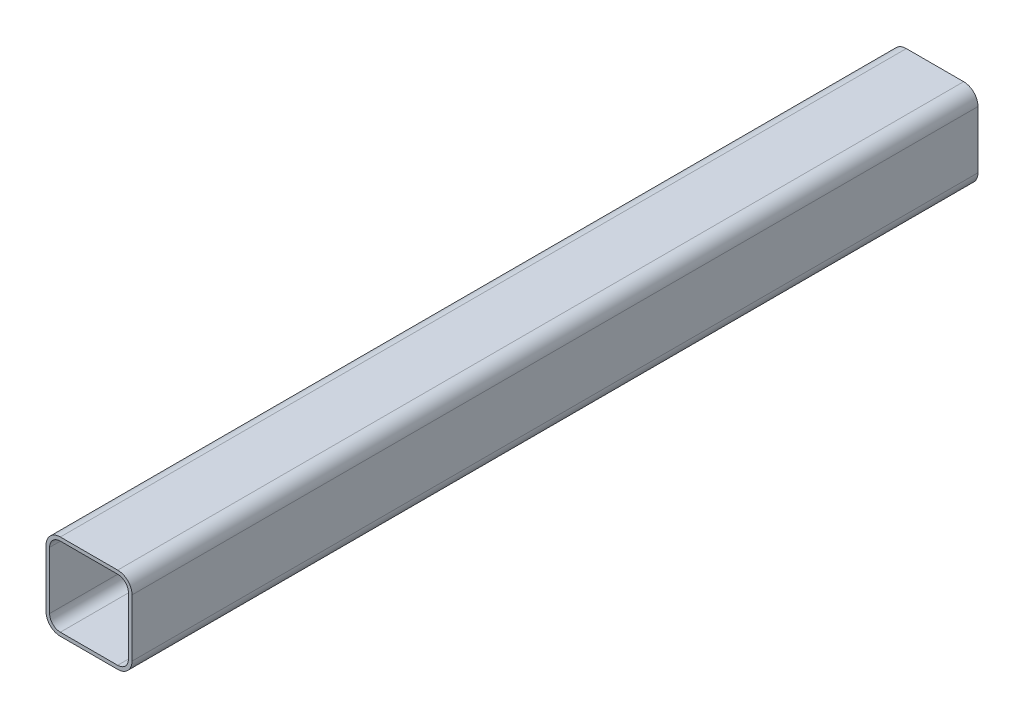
ISO-10303-21;
HEADER;
FILE_DESCRIPTION(('STEP AP214'),'2;1');
FILE_NAME('part.step','',(''),(''),'','','');
FILE_SCHEMA(('AUTOMOTIVE_DESIGN { 1 0 10303 214 1 1 1 1 }'));
ENDSEC;
DATA;
#1=APPLICATION_CONTEXT('core data for automotive mechanical design processes');
#2=APPLICATION_PROTOCOL_DEFINITION('international standard','automotive_design',2000,#1);
#3=PRODUCT_CONTEXT('',#1,'mechanical');
#4=PRODUCT('Part','Part','',(#3));
#5=PRODUCT_RELATED_PRODUCT_CATEGORY('part','',(#4));
#6=PRODUCT_DEFINITION_FORMATION('','',#4);
#7=PRODUCT_DEFINITION_CONTEXT('part definition',#1,'design');
#8=PRODUCT_DEFINITION('design','',#6,#7);
#9=PRODUCT_DEFINITION_SHAPE('','',#8);
#10=(LENGTH_UNIT() NAMED_UNIT(*) SI_UNIT(.MILLI.,.METRE.));
#11=(NAMED_UNIT(*) PLANE_ANGLE_UNIT() SI_UNIT($,.RADIAN.));
#12=(NAMED_UNIT(*) SI_UNIT($,.STERADIAN.) SOLID_ANGLE_UNIT());
#13=UNCERTAINTY_MEASURE_WITH_UNIT(LENGTH_MEASURE(1.E-05),#10,'distance_accuracy_value','');
#14=(GEOMETRIC_REPRESENTATION_CONTEXT(3) GLOBAL_UNCERTAINTY_ASSIGNED_CONTEXT((#13)) GLOBAL_UNIT_ASSIGNED_CONTEXT((#10,
#11,#12)) REPRESENTATION_CONTEXT('',''));
#15=CARTESIAN_POINT('',(0.,0.,0.));
#16=DIRECTION('',(0.,0.,1.));
#17=DIRECTION('',(1.,0.,0.));
#18=AXIS2_PLACEMENT_3D('',#15,#16,#17);
#19=CARTESIAN_POINT('',(25.4,25.4,749.3));
#20=DIRECTION('',(0.,0.,1.));
#21=DIRECTION('',(1.,0.,0.));
#22=AXIS2_PLACEMENT_3D('',#19,#20,#21);
#23=PLANE('',#22);
#24=CARTESIAN_POINT('',(25.4,25.4,749.3));
#25=DIRECTION('',(0.,0.,1.));
#26=DIRECTION('',(1.,0.,0.));
#27=AXIS2_PLACEMENT_3D('',#24,#25,#26);
#28=CIRCLE('',#27,12.7);
#29=CARTESIAN_POINT('',(38.1,25.4,749.3));
#30=VERTEX_POINT('',#29);
#31=CARTESIAN_POINT('',(25.4,38.1,749.3));
#32=VERTEX_POINT('',#31);
#33=EDGE_CURVE('E212',#30,#32,#28,.T.);
#34=ORIENTED_EDGE('',*,*,#33,.T.);
#35=DIRECTION('',(1.,0.,0.));
#36=VECTOR('',#35,1.);
#37=CARTESIAN_POINT('',(-25.4,38.1,749.3));
#38=LINE('',#37,#36);
#39=CARTESIAN_POINT('',(-25.4,38.1,749.3));
#40=VERTEX_POINT('',#39);
#41=EDGE_CURVE('E214',#40,#32,#38,.T.);
#42=ORIENTED_EDGE('',*,*,#41,.F.);
#43=CARTESIAN_POINT('',(-25.4,25.4,749.3));
#44=DIRECTION('',(0.,0.,-1.));
#45=DIRECTION('',(-1.,0.,0.));
#46=AXIS2_PLACEMENT_3D('',#43,#44,#45);
#47=CIRCLE('',#46,12.7);
#48=CARTESIAN_POINT('',(-38.1,25.4,749.3));
#49=VERTEX_POINT('',#48);
#50=EDGE_CURVE('E218',#49,#40,#47,.T.);
#51=ORIENTED_EDGE('',*,*,#50,.F.);
#52=DIRECTION('',(0.,-1.,0.));
#53=VECTOR('',#52,1.);
#54=CARTESIAN_POINT('',(-38.1,25.4,749.3));
#55=LINE('',#54,#53);
#56=CARTESIAN_POINT('',(-38.1,-25.4,749.3));
#57=VERTEX_POINT('',#56);
#58=EDGE_CURVE('E221',#49,#57,#55,.T.);
#59=ORIENTED_EDGE('',*,*,#58,.T.);
#60=CARTESIAN_POINT('',(-25.4,-25.4,749.3));
#61=DIRECTION('',(0.,0.,-1.));
#62=DIRECTION('',(-1.,0.,0.));
#63=AXIS2_PLACEMENT_3D('',#60,#61,#62);
#64=CIRCLE('',#63,12.7);
#65=CARTESIAN_POINT('',(-25.4,-38.1,749.3));
#66=VERTEX_POINT('',#65);
#67=EDGE_CURVE('E223',#66,#57,#64,.T.);
#68=ORIENTED_EDGE('',*,*,#67,.F.);
#69=DIRECTION('',(-1.,0.,0.));
#70=VECTOR('',#69,1.);
#71=CARTESIAN_POINT('',(25.4,-38.1,749.3));
#72=LINE('',#71,#70);
#73=CARTESIAN_POINT('',(25.4,-38.1,749.3));
#74=VERTEX_POINT('',#73);
#75=EDGE_CURVE('E226',#74,#66,#72,.T.);
#76=ORIENTED_EDGE('',*,*,#75,.F.);
#77=CARTESIAN_POINT('',(25.4,-25.4,749.3));
#78=DIRECTION('',(0.,0.,-1.));
#79=DIRECTION('',(-1.,0.,0.));
#80=AXIS2_PLACEMENT_3D('',#77,#78,#79);
#81=CIRCLE('',#80,12.7);
#82=CARTESIAN_POINT('',(38.1,-25.4000000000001,749.3));
#83=VERTEX_POINT('',#82);
#84=EDGE_CURVE('E229',#83,#74,#81,.T.);
#85=ORIENTED_EDGE('',*,*,#84,.F.);
#86=DIRECTION('',(0.,1.,0.));
#87=VECTOR('',#86,1.);
#88=CARTESIAN_POINT('',(38.1,-25.4000000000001,749.3));
#89=LINE('',#88,#87);
#90=EDGE_CURVE('E232',#83,#30,#89,.T.);
#91=ORIENTED_EDGE('',*,*,#90,.T.);
#92=EDGE_LOOP('',(#34,#42,#51,#59,#68,#76,#85,#91));
#93=FACE_BOUND('',#92,.T.);
#94=DIRECTION('',(1.,0.,0.));
#95=VECTOR('',#94,1.);
#96=CARTESIAN_POINT('',(-25.4,34.925,749.3));
#97=LINE('',#96,#95);
#98=CARTESIAN_POINT('',(-25.4,34.925,749.3));
#99=VERTEX_POINT('',#98);
#100=CARTESIAN_POINT('',(25.4,34.925,749.3));
#101=VERTEX_POINT('',#100);
#102=EDGE_CURVE('E152',#99,#101,#97,.T.);
#103=ORIENTED_EDGE('',*,*,#102,.T.);
#104=CARTESIAN_POINT('',(25.4,25.4,749.3));
#105=DIRECTION('',(0.,0.,1.));
#106=DIRECTION('',(1.,0.,0.));
#107=AXIS2_PLACEMENT_3D('',#104,#105,#106);
#108=CIRCLE('',#107,9.525);
#109=CARTESIAN_POINT('',(34.925,25.4,749.3));
#110=VERTEX_POINT('',#109);
#111=EDGE_CURVE('E143',#110,#101,#108,.T.);
#112=ORIENTED_EDGE('',*,*,#111,.F.);
#113=DIRECTION('',(0.,1.,0.));
#114=VECTOR('',#113,1.);
#115=CARTESIAN_POINT('',(34.925,-25.4000000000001,749.3));
#116=LINE('',#115,#114);
#117=CARTESIAN_POINT('',(34.925,-25.4000000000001,749.3));
#118=VERTEX_POINT('',#117);
#119=EDGE_CURVE('E179',#118,#110,#116,.T.);
#120=ORIENTED_EDGE('',*,*,#119,.F.);
#121=CARTESIAN_POINT('',(25.4,-25.4,749.3));
#122=DIRECTION('',(0.,0.,1.));
#123=DIRECTION('',(1.,0.,0.));
#124=AXIS2_PLACEMENT_3D('',#121,#122,#123);
#125=CIRCLE('',#124,9.525);
#126=CARTESIAN_POINT('',(25.4,-34.925,749.3));
#127=VERTEX_POINT('',#126);
#128=EDGE_CURVE('E47',#118,#127,#125,.F.);
#129=ORIENTED_EDGE('',*,*,#128,.T.);
#130=DIRECTION('',(-1.,0.,0.));
#131=VECTOR('',#130,1.);
#132=CARTESIAN_POINT('',(25.4,-34.925,749.3));
#133=LINE('',#132,#131);
#134=CARTESIAN_POINT('',(-25.4,-34.925,749.3));
#135=VERTEX_POINT('',#134);
#136=EDGE_CURVE('E175',#127,#135,#133,.T.);
#137=ORIENTED_EDGE('',*,*,#136,.T.);
#138=CARTESIAN_POINT('',(-25.4,-25.4,749.3));
#139=DIRECTION('',(0.,0.,1.));
#140=DIRECTION('',(1.,0.,0.));
#141=AXIS2_PLACEMENT_3D('',#138,#139,#140);
#142=CIRCLE('',#141,9.52499999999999);
#143=CARTESIAN_POINT('',(-34.925,-25.4,749.3));
#144=VERTEX_POINT('',#143);
#145=EDGE_CURVE('E172',#135,#144,#142,.F.);
#146=ORIENTED_EDGE('',*,*,#145,.T.);
#147=DIRECTION('',(0.,-1.,0.));
#148=VECTOR('',#147,1.);
#149=CARTESIAN_POINT('',(-34.925,25.4,749.3));
#150=LINE('',#149,#148);
#151=CARTESIAN_POINT('',(-34.925,25.4,749.3));
#152=VERTEX_POINT('',#151);
#153=EDGE_CURVE('E168',#152,#144,#150,.T.);
#154=ORIENTED_EDGE('',*,*,#153,.F.);
#155=CARTESIAN_POINT('',(-25.4,25.4,749.3));
#156=DIRECTION('',(0.,0.,1.));
#157=DIRECTION('',(1.,0.,0.));
#158=AXIS2_PLACEMENT_3D('',#155,#156,#157);
#159=CIRCLE('',#158,9.525);
#160=EDGE_CURVE('E166',#152,#99,#159,.F.);
#161=ORIENTED_EDGE('',*,*,#160,.T.);
#162=EDGE_LOOP('',(#103,#112,#120,#129,#137,#146,#154,#161));
#163=FACE_BOUND('',#162,.T.);
#164=ADVANCED_FACE('F32',(#93,#163),#23,.T.);
#165=CARTESIAN_POINT('',(25.4,25.4,0.));
#166=DIRECTION('',(0.,0.,1.));
#167=DIRECTION('',(1.,0.,0.));
#168=AXIS2_PLACEMENT_3D('',#165,#166,#167);
#169=PLANE('',#168);
#170=CARTESIAN_POINT('',(25.4,25.4,0.));
#171=DIRECTION('',(0.,0.,1.));
#172=DIRECTION('',(1.,0.,0.));
#173=AXIS2_PLACEMENT_3D('',#170,#171,#172);
#174=CIRCLE('',#173,12.7);
#175=CARTESIAN_POINT('',(38.1,25.4,0.));
#176=VERTEX_POINT('',#175);
#177=CARTESIAN_POINT('',(25.4,38.1,0.));
#178=VERTEX_POINT('',#177);
#179=EDGE_CURVE('E161',#176,#178,#174,.T.);
#180=ORIENTED_EDGE('',*,*,#179,.F.);
#181=DIRECTION('',(0.,1.,0.));
#182=VECTOR('',#181,1.);
#183=CARTESIAN_POINT('',(38.1,-25.4000000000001,0.));
#184=LINE('',#183,#182);
#185=CARTESIAN_POINT('',(38.1,-25.4000000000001,0.));
#186=VERTEX_POINT('',#185);
#187=EDGE_CURVE('E215',#186,#176,#184,.T.);
#188=ORIENTED_EDGE('',*,*,#187,.F.);
#189=CARTESIAN_POINT('',(25.4,-25.4,0.));
#190=DIRECTION('',(0.,0.,-1.));
#191=DIRECTION('',(-1.,0.,0.));
#192=AXIS2_PLACEMENT_3D('',#189,#190,#191);
#193=CIRCLE('',#192,12.7);
#194=CARTESIAN_POINT('',(25.4,-38.1,0.));
#195=VERTEX_POINT('',#194);
#196=EDGE_CURVE('E252',#186,#195,#193,.T.);
#197=ORIENTED_EDGE('',*,*,#196,.T.);
#198=DIRECTION('',(-1.,0.,0.));
#199=VECTOR('',#198,1.);
#200=CARTESIAN_POINT('',(25.4,-38.1,0.));
#201=LINE('',#200,#199);
#202=CARTESIAN_POINT('',(-25.4,-38.1,0.));
#203=VERTEX_POINT('',#202);
#204=EDGE_CURVE('E249',#195,#203,#201,.T.);
#205=ORIENTED_EDGE('',*,*,#204,.T.);
#206=CARTESIAN_POINT('',(-25.4,-25.4,0.));
#207=DIRECTION('',(0.,0.,-1.));
#208=DIRECTION('',(-1.,0.,0.));
#209=AXIS2_PLACEMENT_3D('',#206,#207,#208);
#210=CIRCLE('',#209,12.7);
#211=CARTESIAN_POINT('',(-38.1,-25.4,0.));
#212=VERTEX_POINT('',#211);
#213=EDGE_CURVE('E246',#203,#212,#210,.T.);
#214=ORIENTED_EDGE('',*,*,#213,.T.);
#215=DIRECTION('',(0.,-1.,0.));
#216=VECTOR('',#215,1.);
#217=CARTESIAN_POINT('',(-38.1,25.4,0.));
#218=LINE('',#217,#216);
#219=CARTESIAN_POINT('',(-38.1,25.4,0.));
#220=VERTEX_POINT('',#219);
#221=EDGE_CURVE('E243',#220,#212,#218,.T.);
#222=ORIENTED_EDGE('',*,*,#221,.F.);
#223=CARTESIAN_POINT('',(-25.4,25.4,0.));
#224=DIRECTION('',(0.,0.,-1.));
#225=DIRECTION('',(-1.,0.,0.));
#226=AXIS2_PLACEMENT_3D('',#223,#224,#225);
#227=CIRCLE('',#226,12.7);
#228=CARTESIAN_POINT('',(-25.4,38.1,0.));
#229=VERTEX_POINT('',#228);
#230=EDGE_CURVE('E240',#220,#229,#227,.T.);
#231=ORIENTED_EDGE('',*,*,#230,.T.);
#232=DIRECTION('',(1.,0.,0.));
#233=VECTOR('',#232,1.);
#234=CARTESIAN_POINT('',(-25.4,38.1,0.));
#235=LINE('',#234,#233);
#236=EDGE_CURVE('E237',#229,#178,#235,.T.);
#237=ORIENTED_EDGE('',*,*,#236,.T.);
#238=EDGE_LOOP('',(#180,#188,#197,#205,#214,#222,#231,#237));
#239=FACE_BOUND('',#238,.T.);
#240=CARTESIAN_POINT('',(25.4,25.4,0.));
#241=DIRECTION('',(0.,0.,1.));
#242=DIRECTION('',(1.,0.,0.));
#243=AXIS2_PLACEMENT_3D('',#240,#241,#242);
#244=CIRCLE('',#243,9.525);
#245=CARTESIAN_POINT('',(34.925,25.4,0.));
#246=VERTEX_POINT('',#245);
#247=CARTESIAN_POINT('',(25.4,34.925,0.));
#248=VERTEX_POINT('',#247);
#249=EDGE_CURVE('E55',#246,#248,#244,.T.);
#250=ORIENTED_EDGE('',*,*,#249,.T.);
#251=DIRECTION('',(1.,0.,0.));
#252=VECTOR('',#251,1.);
#253=CARTESIAN_POINT('',(-25.4,34.925,0.));
#254=LINE('',#253,#252);
#255=CARTESIAN_POINT('',(-25.4,34.925,0.));
#256=VERTEX_POINT('',#255);
#257=EDGE_CURVE('E160',#256,#248,#254,.T.);
#258=ORIENTED_EDGE('',*,*,#257,.F.);
#259=CARTESIAN_POINT('',(-25.4,25.4,0.));
#260=DIRECTION('',(0.,0.,1.));
#261=DIRECTION('',(1.,0.,0.));
#262=AXIS2_PLACEMENT_3D('',#259,#260,#261);
#263=CIRCLE('',#262,9.525);
#264=CARTESIAN_POINT('',(-34.925,25.4,0.));
#265=VERTEX_POINT('',#264);
#266=EDGE_CURVE('E183',#265,#256,#263,.F.);
#267=ORIENTED_EDGE('',*,*,#266,.F.);
#268=DIRECTION('',(0.,-1.,0.));
#269=VECTOR('',#268,1.);
#270=CARTESIAN_POINT('',(-34.925,25.4,0.));
#271=LINE('',#270,#269);
#272=CARTESIAN_POINT('',(-34.925,-25.4,0.));
#273=VERTEX_POINT('',#272);
#274=EDGE_CURVE('E186',#265,#273,#271,.T.);
#275=ORIENTED_EDGE('',*,*,#274,.T.);
#276=CARTESIAN_POINT('',(-25.4,-25.4,0.));
#277=DIRECTION('',(0.,0.,1.));
#278=DIRECTION('',(1.,0.,0.));
#279=AXIS2_PLACEMENT_3D('',#276,#277,#278);
#280=CIRCLE('',#279,9.52499999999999);
#281=CARTESIAN_POINT('',(-25.4,-34.925,0.));
#282=VERTEX_POINT('',#281);
#283=EDGE_CURVE('E189',#282,#273,#280,.F.);
#284=ORIENTED_EDGE('',*,*,#283,.F.);
#285=DIRECTION('',(-1.,0.,0.));
#286=VECTOR('',#285,1.);
#287=CARTESIAN_POINT('',(25.4,-34.925,0.));
#288=LINE('',#287,#286);
#289=CARTESIAN_POINT('',(25.4,-34.925,0.));
#290=VERTEX_POINT('',#289);
#291=EDGE_CURVE('E192',#290,#282,#288,.T.);
#292=ORIENTED_EDGE('',*,*,#291,.F.);
#293=CARTESIAN_POINT('',(25.4,-25.4,0.));
#294=DIRECTION('',(0.,0.,1.));
#295=DIRECTION('',(1.,0.,0.));
#296=AXIS2_PLACEMENT_3D('',#293,#294,#295);
#297=CIRCLE('',#296,9.525);
#298=CARTESIAN_POINT('',(34.925,-25.4000000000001,0.));
#299=VERTEX_POINT('',#298);
#300=EDGE_CURVE('E195',#299,#290,#297,.F.);
#301=ORIENTED_EDGE('',*,*,#300,.F.);
#302=DIRECTION('',(0.,1.,0.));
#303=VECTOR('',#302,1.);
#304=CARTESIAN_POINT('',(34.925,-25.4000000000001,0.));
#305=LINE('',#304,#303);
#306=EDGE_CURVE('E153',#299,#246,#305,.T.);
#307=ORIENTED_EDGE('',*,*,#306,.T.);
#308=EDGE_LOOP('',(#250,#258,#267,#275,#284,#292,#301,#307));
#309=FACE_BOUND('',#308,.T.);
#310=ADVANCED_FACE('F279',(#239,#309),#169,.F.);
#311=CARTESIAN_POINT('',(25.4,25.4,749.3));
#312=DIRECTION('',(0.,0.,-1.));
#313=DIRECTION('',(-1.,0.,0.));
#314=AXIS2_PLACEMENT_3D('',#311,#312,#313);
#315=CYLINDRICAL_SURFACE('',#314,12.7);
#316=ORIENTED_EDGE('',*,*,#179,.T.);
#317=DIRECTION('',(0.,0.,-1.));
#318=VECTOR('',#317,1.);
#319=CARTESIAN_POINT('',(25.4,38.1,749.3));
#320=LINE('',#319,#318);
#321=EDGE_CURVE('E11',#32,#178,#320,.T.);
#322=ORIENTED_EDGE('',*,*,#321,.F.);
#323=ORIENTED_EDGE('',*,*,#33,.F.);
#324=DIRECTION('',(0.,0.,-1.));
#325=VECTOR('',#324,1.);
#326=CARTESIAN_POINT('',(38.1,25.4,749.3));
#327=LINE('',#326,#325);
#328=EDGE_CURVE('E234',#30,#176,#327,.T.);
#329=ORIENTED_EDGE('',*,*,#328,.T.);
#330=EDGE_LOOP('',(#316,#322,#323,#329));
#331=FACE_BOUND('',#330,.T.);
#332=ADVANCED_FACE('F34',(#331),#315,.T.);
#333=CARTESIAN_POINT('',(-25.4,38.1,749.3));
#334=DIRECTION('',(0.,1.,0.));
#335=DIRECTION('',(-1.,0.,0.));
#336=AXIS2_PLACEMENT_3D('',#333,#334,#335);
#337=PLANE('',#336);
#338=ORIENTED_EDGE('',*,*,#236,.F.);
#339=DIRECTION('',(0.,0.,-1.));
#340=VECTOR('',#339,1.);
#341=CARTESIAN_POINT('',(-25.4,38.1,749.3));
#342=LINE('',#341,#340);
#343=EDGE_CURVE('E40',#40,#229,#342,.T.);
#344=ORIENTED_EDGE('',*,*,#343,.F.);
#345=ORIENTED_EDGE('',*,*,#41,.T.);
#346=ORIENTED_EDGE('',*,*,#321,.T.);
#347=EDGE_LOOP('',(#338,#344,#345,#346));
#348=FACE_BOUND('',#347,.T.);
#349=ADVANCED_FACE('F274',(#348),#337,.T.);
#350=CARTESIAN_POINT('',(-25.4,25.4,749.3));
#351=DIRECTION('',(0.,0.,-1.));
#352=DIRECTION('',(-1.,0.,0.));
#353=AXIS2_PLACEMENT_3D('',#350,#351,#352);
#354=CYLINDRICAL_SURFACE('',#353,12.7);
#355=ORIENTED_EDGE('',*,*,#230,.F.);
#356=DIRECTION('',(0.,0.,-1.));
#357=VECTOR('',#356,1.);
#358=CARTESIAN_POINT('',(-38.1,25.4,749.3));
#359=LINE('',#358,#357);
#360=EDGE_CURVE('E266',#49,#220,#359,.T.);
#361=ORIENTED_EDGE('',*,*,#360,.F.);
#362=ORIENTED_EDGE('',*,*,#50,.T.);
#363=ORIENTED_EDGE('',*,*,#343,.T.);
#364=EDGE_LOOP('',(#355,#361,#362,#363));
#365=FACE_BOUND('',#364,.T.);
#366=ADVANCED_FACE('F270',(#365),#354,.T.);
#367=CARTESIAN_POINT('',(-38.1,25.4,749.3));
#368=DIRECTION('',(1.,0.,0.));
#369=DIRECTION('',(0.,1.,0.));
#370=AXIS2_PLACEMENT_3D('',#367,#368,#369);
#371=PLANE('',#370);
#372=ORIENTED_EDGE('',*,*,#221,.T.);
#373=DIRECTION('',(0.,0.,-1.));
#374=VECTOR('',#373,1.);
#375=CARTESIAN_POINT('',(-38.1,-25.4,749.3));
#376=LINE('',#375,#374);
#377=EDGE_CURVE('E264',#57,#212,#376,.T.);
#378=ORIENTED_EDGE('',*,*,#377,.F.);
#379=ORIENTED_EDGE('',*,*,#58,.F.);
#380=ORIENTED_EDGE('',*,*,#360,.T.);
#381=EDGE_LOOP('',(#372,#378,#379,#380));
#382=FACE_BOUND('',#381,.T.);
#383=ADVANCED_FACE('F284',(#382),#371,.F.);
#384=CARTESIAN_POINT('',(-25.4,-25.4,749.3));
#385=DIRECTION('',(0.,0.,-1.));
#386=DIRECTION('',(-1.,0.,0.));
#387=AXIS2_PLACEMENT_3D('',#384,#385,#386);
#388=CYLINDRICAL_SURFACE('',#387,12.7);
#389=ORIENTED_EDGE('',*,*,#213,.F.);
#390=DIRECTION('',(0.,0.,-1.));
#391=VECTOR('',#390,1.);
#392=CARTESIAN_POINT('',(-25.4,-38.1,749.3));
#393=LINE('',#392,#391);
#394=EDGE_CURVE('E262',#66,#203,#393,.T.);
#395=ORIENTED_EDGE('',*,*,#394,.F.);
#396=ORIENTED_EDGE('',*,*,#67,.T.);
#397=ORIENTED_EDGE('',*,*,#377,.T.);
#398=EDGE_LOOP('',(#389,#395,#396,#397));
#399=FACE_BOUND('',#398,.T.);
#400=ADVANCED_FACE('F303',(#399),#388,.T.);
#401=CARTESIAN_POINT('',(25.4,-38.1,749.3));
#402=DIRECTION('',(0.,-1.,0.));
#403=DIRECTION('',(1.,0.,0.));
#404=AXIS2_PLACEMENT_3D('',#401,#402,#403);
#405=PLANE('',#404);
#406=ORIENTED_EDGE('',*,*,#204,.F.);
#407=DIRECTION('',(0.,0.,-1.));
#408=VECTOR('',#407,1.);
#409=CARTESIAN_POINT('',(25.4,-38.1,749.3));
#410=LINE('',#409,#408);
#411=EDGE_CURVE('E260',#74,#195,#410,.T.);
#412=ORIENTED_EDGE('',*,*,#411,.F.);
#413=ORIENTED_EDGE('',*,*,#75,.T.);
#414=ORIENTED_EDGE('',*,*,#394,.T.);
#415=EDGE_LOOP('',(#406,#412,#413,#414));
#416=FACE_BOUND('',#415,.T.);
#417=ADVANCED_FACE('F301',(#416),#405,.T.);
#418=CARTESIAN_POINT('',(25.4,-25.4,749.3));
#419=DIRECTION('',(0.,0.,-1.));
#420=DIRECTION('',(-1.,0.,0.));
#421=AXIS2_PLACEMENT_3D('',#418,#419,#420);
#422=CYLINDRICAL_SURFACE('',#421,12.7);
#423=ORIENTED_EDGE('',*,*,#196,.F.);
#424=DIRECTION('',(0.,0.,-1.));
#425=VECTOR('',#424,1.);
#426=CARTESIAN_POINT('',(38.1,-25.4000000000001,749.3));
#427=LINE('',#426,#425);
#428=EDGE_CURVE('E258',#83,#186,#427,.T.);
#429=ORIENTED_EDGE('',*,*,#428,.F.);
#430=ORIENTED_EDGE('',*,*,#84,.T.);
#431=ORIENTED_EDGE('',*,*,#411,.T.);
#432=EDGE_LOOP('',(#423,#429,#430,#431));
#433=FACE_BOUND('',#432,.T.);
#434=ADVANCED_FACE('F297',(#433),#422,.T.);
#435=CARTESIAN_POINT('',(38.1,-25.4000000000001,749.3));
#436=DIRECTION('',(-1.,0.,0.));
#437=DIRECTION('',(0.,-1.,0.));
#438=AXIS2_PLACEMENT_3D('',#435,#436,#437);
#439=PLANE('',#438);
#440=ORIENTED_EDGE('',*,*,#187,.T.);
#441=ORIENTED_EDGE('',*,*,#328,.F.);
#442=ORIENTED_EDGE('',*,*,#90,.F.);
#443=ORIENTED_EDGE('',*,*,#428,.T.);
#444=EDGE_LOOP('',(#440,#441,#442,#443));
#445=FACE_BOUND('',#444,.T.);
#446=ADVANCED_FACE('F321',(#445),#439,.F.);
#447=CARTESIAN_POINT('',(25.4,25.4,749.3));
#448=DIRECTION('',(0.,0.,-1.));
#449=DIRECTION('',(-1.,0.,0.));
#450=AXIS2_PLACEMENT_3D('',#447,#448,#449);
#451=CYLINDRICAL_SURFACE('',#450,9.525);
#452=ORIENTED_EDGE('',*,*,#249,.F.);
#453=DIRECTION('',(0.,0.,-1.));
#454=VECTOR('',#453,1.);
#455=CARTESIAN_POINT('',(34.925,25.4,749.3));
#456=LINE('',#455,#454);
#457=EDGE_CURVE('E148',#110,#246,#456,.T.);
#458=ORIENTED_EDGE('',*,*,#457,.F.);
#459=ORIENTED_EDGE('',*,*,#111,.T.);
#460=DIRECTION('',(0.,0.,-1.));
#461=VECTOR('',#460,1.);
#462=CARTESIAN_POINT('',(25.4,34.925,749.3));
#463=LINE('',#462,#461);
#464=EDGE_CURVE('E146',#101,#248,#463,.T.);
#465=ORIENTED_EDGE('',*,*,#464,.T.);
#466=EDGE_LOOP('',(#452,#458,#459,#465));
#467=FACE_BOUND('',#466,.T.);
#468=ADVANCED_FACE('F145',(#467),#451,.F.);
#469=CARTESIAN_POINT('',(-25.4,34.925,749.3));
#470=DIRECTION('',(0.,1.,0.));
#471=DIRECTION('',(-1.,0.,0.));
#472=AXIS2_PLACEMENT_3D('',#469,#470,#471);
#473=PLANE('',#472);
#474=ORIENTED_EDGE('',*,*,#257,.T.);
#475=ORIENTED_EDGE('',*,*,#464,.F.);
#476=ORIENTED_EDGE('',*,*,#102,.F.);
#477=DIRECTION('',(0.,0.,-1.));
#478=VECTOR('',#477,1.);
#479=CARTESIAN_POINT('',(-25.4,34.925,749.3));
#480=LINE('',#479,#478);
#481=EDGE_CURVE('E162',#99,#256,#480,.T.);
#482=ORIENTED_EDGE('',*,*,#481,.T.);
#483=EDGE_LOOP('',(#474,#475,#476,#482));
#484=FACE_BOUND('',#483,.T.);
#485=ADVANCED_FACE('F157',(#484),#473,.F.);
#486=CARTESIAN_POINT('',(-25.4,25.4,749.3));
#487=DIRECTION('',(0.,0.,-1.));
#488=DIRECTION('',(-1.,0.,0.));
#489=AXIS2_PLACEMENT_3D('',#486,#487,#488);
#490=CYLINDRICAL_SURFACE('',#489,9.525);
#491=ORIENTED_EDGE('',*,*,#266,.T.);
#492=ORIENTED_EDGE('',*,*,#481,.F.);
#493=ORIENTED_EDGE('',*,*,#160,.F.);
#494=DIRECTION('',(0.,0.,-1.));
#495=VECTOR('',#494,1.);
#496=CARTESIAN_POINT('',(-34.925,25.4,749.3));
#497=LINE('',#496,#495);
#498=EDGE_CURVE('E209',#152,#265,#497,.T.);
#499=ORIENTED_EDGE('',*,*,#498,.T.);
#500=EDGE_LOOP('',(#491,#492,#493,#499));
#501=FACE_BOUND('',#500,.T.);
#502=ADVANCED_FACE('F344',(#501),#490,.F.);
#503=CARTESIAN_POINT('',(-34.925,25.4,749.3));
#504=DIRECTION('',(1.,0.,0.));
#505=DIRECTION('',(0.,1.,0.));
#506=AXIS2_PLACEMENT_3D('',#503,#504,#505);
#507=PLANE('',#506);
#508=ORIENTED_EDGE('',*,*,#274,.F.);
#509=ORIENTED_EDGE('',*,*,#498,.F.);
#510=ORIENTED_EDGE('',*,*,#153,.T.);
#511=DIRECTION('',(0.,0.,-1.));
#512=VECTOR('',#511,1.);
#513=CARTESIAN_POINT('',(-34.925,-25.4,749.3));
#514=LINE('',#513,#512);
#515=EDGE_CURVE('E207',#144,#273,#514,.T.);
#516=ORIENTED_EDGE('',*,*,#515,.T.);
#517=EDGE_LOOP('',(#508,#509,#510,#516));
#518=FACE_BOUND('',#517,.T.);
#519=ADVANCED_FACE('F350',(#518),#507,.T.);
#520=CARTESIAN_POINT('',(-25.4,-25.4,749.3));
#521=DIRECTION('',(0.,0.,-1.));
#522=DIRECTION('',(-1.,0.,0.));
#523=AXIS2_PLACEMENT_3D('',#520,#521,#522);
#524=CYLINDRICAL_SURFACE('',#523,9.52499999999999);
#525=ORIENTED_EDGE('',*,*,#283,.T.);
#526=ORIENTED_EDGE('',*,*,#515,.F.);
#527=ORIENTED_EDGE('',*,*,#145,.F.);
#528=DIRECTION('',(0.,0.,-1.));
#529=VECTOR('',#528,1.);
#530=CARTESIAN_POINT('',(-25.4,-34.925,749.3));
#531=LINE('',#530,#529);
#532=EDGE_CURVE('E205',#135,#282,#531,.T.);
#533=ORIENTED_EDGE('',*,*,#532,.T.);
#534=EDGE_LOOP('',(#525,#526,#527,#533));
#535=FACE_BOUND('',#534,.T.);
#536=ADVANCED_FACE('F358',(#535),#524,.F.);
#537=CARTESIAN_POINT('',(25.4,-34.925,749.3));
#538=DIRECTION('',(0.,-1.,0.));
#539=DIRECTION('',(1.,0.,0.));
#540=AXIS2_PLACEMENT_3D('',#537,#538,#539);
#541=PLANE('',#540);
#542=ORIENTED_EDGE('',*,*,#291,.T.);
#543=ORIENTED_EDGE('',*,*,#532,.F.);
#544=ORIENTED_EDGE('',*,*,#136,.F.);
#545=DIRECTION('',(0.,0.,-1.));
#546=VECTOR('',#545,1.);
#547=CARTESIAN_POINT('',(25.4,-34.925,749.3));
#548=LINE('',#547,#546);
#549=EDGE_CURVE('E203',#127,#290,#548,.T.);
#550=ORIENTED_EDGE('',*,*,#549,.T.);
#551=EDGE_LOOP('',(#542,#543,#544,#550));
#552=FACE_BOUND('',#551,.T.);
#553=ADVANCED_FACE('F366',(#552),#541,.F.);
#554=CARTESIAN_POINT('',(25.4,-25.4,749.3));
#555=DIRECTION('',(0.,0.,-1.));
#556=DIRECTION('',(-1.,0.,0.));
#557=AXIS2_PLACEMENT_3D('',#554,#555,#556);
#558=CYLINDRICAL_SURFACE('',#557,9.525);
#559=ORIENTED_EDGE('',*,*,#300,.T.);
#560=ORIENTED_EDGE('',*,*,#549,.F.);
#561=ORIENTED_EDGE('',*,*,#128,.F.);
#562=DIRECTION('',(0.,0.,-1.));
#563=VECTOR('',#562,1.);
#564=CARTESIAN_POINT('',(34.925,-25.4000000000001,749.3));
#565=LINE('',#564,#563);
#566=EDGE_CURVE('E201',#118,#299,#565,.T.);
#567=ORIENTED_EDGE('',*,*,#566,.T.);
#568=EDGE_LOOP('',(#559,#560,#561,#567));
#569=FACE_BOUND('',#568,.T.);
#570=ADVANCED_FACE('F374',(#569),#558,.F.);
#571=CARTESIAN_POINT('',(34.925,-25.4000000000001,749.3));
#572=DIRECTION('',(-1.,0.,0.));
#573=DIRECTION('',(0.,-1.,0.));
#574=AXIS2_PLACEMENT_3D('',#571,#572,#573);
#575=PLANE('',#574);
#576=ORIENTED_EDGE('',*,*,#306,.F.);
#577=ORIENTED_EDGE('',*,*,#566,.F.);
#578=ORIENTED_EDGE('',*,*,#119,.T.);
#579=ORIENTED_EDGE('',*,*,#457,.T.);
#580=EDGE_LOOP('',(#576,#577,#578,#579));
#581=FACE_BOUND('',#580,.T.);
#582=ADVANCED_FACE('F382',(#581),#575,.T.);
#583=CLOSED_SHELL('',(#164,#310,#332,#349,#366,#383,#400,#417,#434,#446,#468,#485,#502,#519,
#536,#553,#570,#582));
#584=MANIFOLD_SOLID_BREP('B2',#583);
#585=ADVANCED_BREP_SHAPE_REPRESENTATION('',(#18,#584),#14);
#586=SHAPE_DEFINITION_REPRESENTATION(#9,#585);
ENDSEC;
END-ISO-10303-21;
